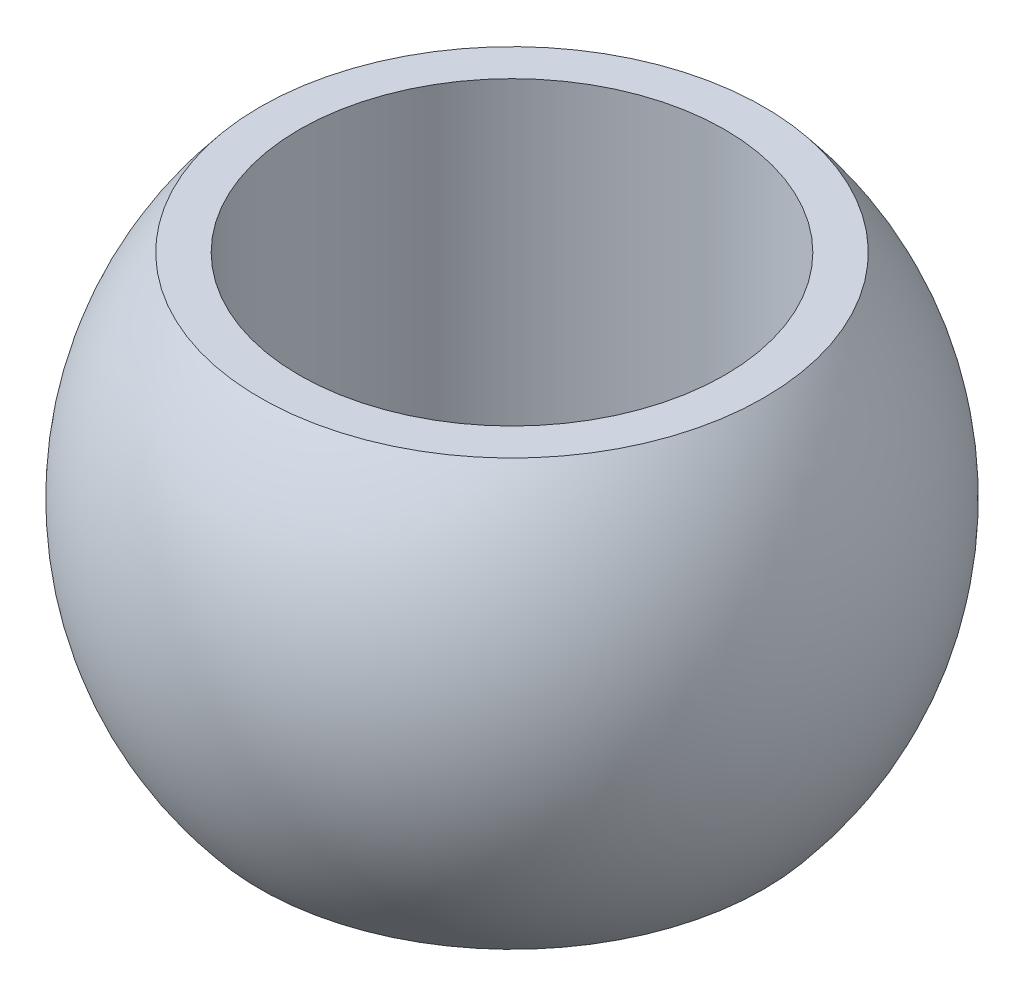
from build123d import *


with BuildPart() as part:
    # Sketch1 → Revolve1 (revolve)
    with BuildSketch(Plane.XY):
        with BuildLine():
            Line((9.40015843, 7.9375), (7.9375, 7.9375))
            Line((7.9375, 7.9375), (7.9375, -7.9375))
            Line((7.9375, -7.9375), (9.40015843, -7.9375))
            ThreePointArc((9.40015843, -7.9375), (12.303125, 0), (9.40015843, 7.9375))
        make_face()
    revolve(axis=Axis((0, 55, 0), (0, -1, 0)))


solid = part.part
